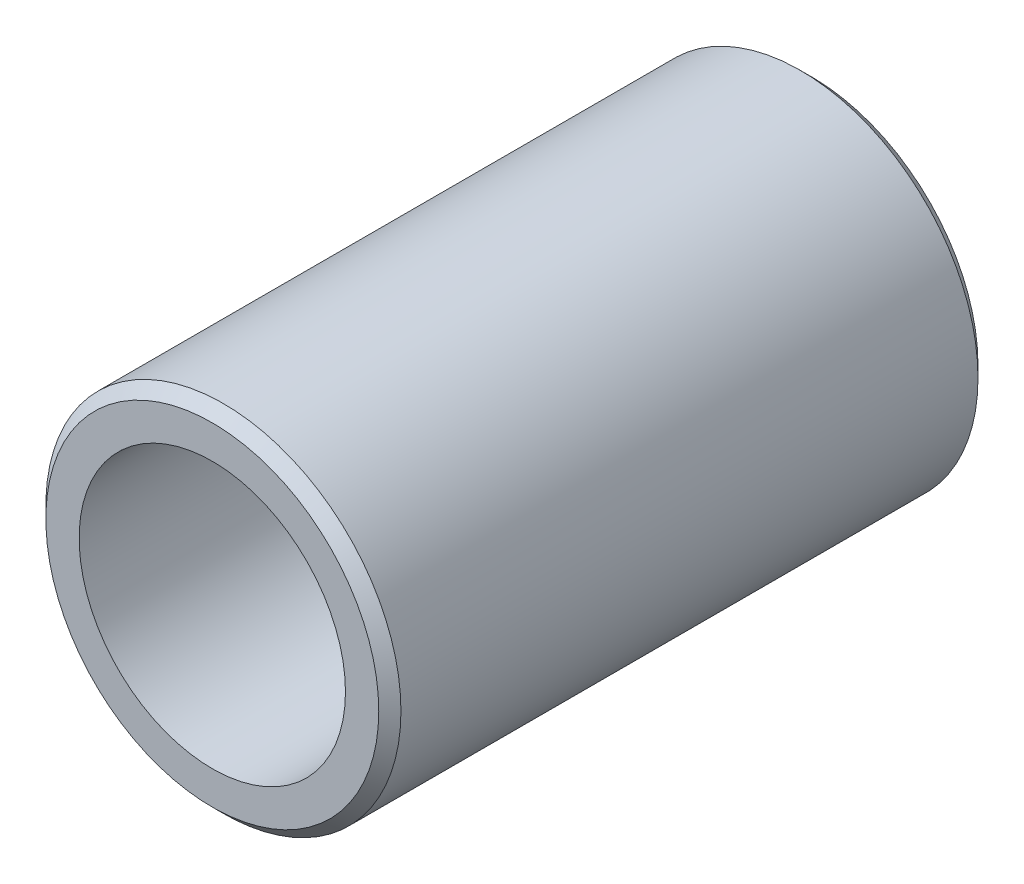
ISO-10303-21;
HEADER;
FILE_DESCRIPTION(('STEP AP214'),'2;1');
FILE_NAME('part.step','',(''),(''),'','','');
FILE_SCHEMA(('AUTOMOTIVE_DESIGN { 1 0 10303 214 1 1 1 1 }'));
ENDSEC;
DATA;
#1=APPLICATION_CONTEXT('core data for automotive mechanical design processes');
#2=APPLICATION_PROTOCOL_DEFINITION('international standard','automotive_design',2000,#1);
#3=PRODUCT_CONTEXT('',#1,'mechanical');
#4=PRODUCT('Part','Part','',(#3));
#5=PRODUCT_RELATED_PRODUCT_CATEGORY('part','',(#4));
#6=PRODUCT_DEFINITION_FORMATION('','',#4);
#7=PRODUCT_DEFINITION_CONTEXT('part definition',#1,'design');
#8=PRODUCT_DEFINITION('design','',#6,#7);
#9=PRODUCT_DEFINITION_SHAPE('','',#8);
#10=(LENGTH_UNIT() NAMED_UNIT(*) SI_UNIT(.MILLI.,.METRE.));
#11=(NAMED_UNIT(*) PLANE_ANGLE_UNIT() SI_UNIT($,.RADIAN.));
#12=(NAMED_UNIT(*) SI_UNIT($,.STERADIAN.) SOLID_ANGLE_UNIT());
#13=UNCERTAINTY_MEASURE_WITH_UNIT(LENGTH_MEASURE(1.E-05),#10,'distance_accuracy_value','');
#14=(GEOMETRIC_REPRESENTATION_CONTEXT(3) GLOBAL_UNCERTAINTY_ASSIGNED_CONTEXT((#13)) GLOBAL_UNIT_ASSIGNED_CONTEXT((#10,
#11,#12)) REPRESENTATION_CONTEXT('',''));
#15=CARTESIAN_POINT('',(0.,0.,0.));
#16=DIRECTION('',(0.,0.,1.));
#17=DIRECTION('',(1.,0.,0.));
#18=AXIS2_PLACEMENT_3D('',#15,#16,#17);
#19=CARTESIAN_POINT('',(0.,0.,27.));
#20=DIRECTION('',(0.,0.,1.));
#21=DIRECTION('',(1.,0.,0.));
#22=AXIS2_PLACEMENT_3D('',#19,#20,#21);
#23=PLANE('',#22);
#24=CARTESIAN_POINT('',(0.,0.,27.));
#25=DIRECTION('',(0.,0.,1.));
#26=DIRECTION('',(1.,0.,0.));
#27=AXIS2_PLACEMENT_3D('',#24,#25,#26);
#28=CIRCLE('',#27,7.49999999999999);
#29=CARTESIAN_POINT('',(7.49999999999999,0.,27.));
#30=VERTEX_POINT('',#29);
#31=EDGE_CURVE('E10',#30,#30,#28,.T.);
#32=ORIENTED_EDGE('',*,*,#31,.T.);
#33=EDGE_LOOP('',(#32));
#34=FACE_BOUND('',#33,.T.);
#35=CARTESIAN_POINT('',(0.,0.,27.));
#36=DIRECTION('',(0.,0.,1.));
#37=DIRECTION('',(1.,0.,0.));
#38=AXIS2_PLACEMENT_3D('',#35,#36,#37);
#39=CIRCLE('',#38,6.);
#40=CARTESIAN_POINT('',(6.,0.,27.));
#41=VERTEX_POINT('',#40);
#42=EDGE_CURVE('E50',#41,#41,#39,.T.);
#43=ORIENTED_EDGE('',*,*,#42,.F.);
#44=EDGE_LOOP('',(#43));
#45=FACE_BOUND('',#44,.T.);
#46=ADVANCED_FACE('F30',(#34,#45),#23,.T.);
#47=CARTESIAN_POINT('',(0.,0.,0.));
#48=DIRECTION('',(0.,0.,1.));
#49=DIRECTION('',(1.,0.,0.));
#50=AXIS2_PLACEMENT_3D('',#47,#48,#49);
#51=PLANE('',#50);
#52=CARTESIAN_POINT('',(0.,0.,0.));
#53=DIRECTION('',(0.,0.,1.));
#54=DIRECTION('',(1.,0.,0.));
#55=AXIS2_PLACEMENT_3D('',#52,#53,#54);
#56=CIRCLE('',#55,7.5);
#57=CARTESIAN_POINT('',(7.5,0.,0.));
#58=VERTEX_POINT('',#57);
#59=EDGE_CURVE('E37',#58,#58,#56,.F.);
#60=ORIENTED_EDGE('',*,*,#59,.T.);
#61=EDGE_LOOP('',(#60));
#62=FACE_BOUND('',#61,.T.);
#63=CARTESIAN_POINT('',(0.,0.,0.));
#64=DIRECTION('',(0.,0.,1.));
#65=DIRECTION('',(1.,0.,0.));
#66=AXIS2_PLACEMENT_3D('',#63,#64,#65);
#67=CIRCLE('',#66,6.);
#68=CARTESIAN_POINT('',(6.,0.,0.));
#69=VERTEX_POINT('',#68);
#70=EDGE_CURVE('E51',#69,#69,#67,.T.);
#71=ORIENTED_EDGE('',*,*,#70,.T.);
#72=EDGE_LOOP('',(#71));
#73=FACE_BOUND('',#72,.T.);
#74=ADVANCED_FACE('F61',(#62,#73),#51,.F.);
#75=CARTESIAN_POINT('',(0.,0.,27.));
#76=DIRECTION('',(0.,0.,-1.));
#77=DIRECTION('',(-1.,0.,0.));
#78=AXIS2_PLACEMENT_3D('',#75,#76,#77);
#79=CYLINDRICAL_SURFACE('',#78,8.);
#80=CARTESIAN_POINT('',(0.,0.,0.500000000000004));
#81=DIRECTION('',(0.,0.,1.));
#82=DIRECTION('',(1.,0.,0.));
#83=AXIS2_PLACEMENT_3D('',#80,#81,#82);
#84=CIRCLE('',#83,8.);
#85=CARTESIAN_POINT('',(8.,0.,0.500000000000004));
#86=VERTEX_POINT('',#85);
#87=EDGE_CURVE('E41',#86,#86,#84,.T.);
#88=ORIENTED_EDGE('',*,*,#87,.T.);
#89=EDGE_LOOP('',(#88));
#90=FACE_BOUND('',#89,.T.);
#91=CARTESIAN_POINT('',(0.,0.,26.5));
#92=DIRECTION('',(0.,0.,1.));
#93=DIRECTION('',(1.,0.,0.));
#94=AXIS2_PLACEMENT_3D('',#91,#92,#93);
#95=CIRCLE('',#94,8.);
#96=CARTESIAN_POINT('',(8.,0.,26.5));
#97=VERTEX_POINT('',#96);
#98=EDGE_CURVE('E45',#97,#97,#95,.F.);
#99=ORIENTED_EDGE('',*,*,#98,.T.);
#100=EDGE_LOOP('',(#99));
#101=FACE_BOUND('',#100,.T.);
#102=ADVANCED_FACE('F66',(#90,#101),#79,.T.);
#103=CARTESIAN_POINT('',(0.,0.,27.));
#104=DIRECTION('',(0.,0.,-1.));
#105=DIRECTION('',(-1.,0.,0.));
#106=AXIS2_PLACEMENT_3D('',#103,#104,#105);
#107=CYLINDRICAL_SURFACE('',#106,6.);
#108=ORIENTED_EDGE('',*,*,#42,.T.);
#109=EDGE_LOOP('',(#108));
#110=FACE_BOUND('',#109,.T.);
#111=ORIENTED_EDGE('',*,*,#70,.F.);
#112=EDGE_LOOP('',(#111));
#113=FACE_BOUND('',#112,.T.);
#114=ADVANCED_FACE('F57',(#110,#113),#107,.F.);
#115=CARTESIAN_POINT('',(0.,0.,0.500000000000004));
#116=DIRECTION('',(0.,0.,1.));
#117=DIRECTION('',(1.,0.,0.));
#118=AXIS2_PLACEMENT_3D('',#115,#116,#117);
#119=CONICAL_SURFACE('',#118,8.,0.785398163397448);
#120=ORIENTED_EDGE('',*,*,#59,.F.);
#121=EDGE_LOOP('',(#120));
#122=FACE_BOUND('',#121,.T.);
#123=ORIENTED_EDGE('',*,*,#87,.F.);
#124=EDGE_LOOP('',(#123));
#125=FACE_BOUND('',#124,.T.);
#126=ADVANCED_FACE('F72',(#122,#125),#119,.T.);
#127=CARTESIAN_POINT('',(0.,0.,27.));
#128=DIRECTION('',(0.,0.,-1.));
#129=DIRECTION('',(-1.,0.,0.));
#130=AXIS2_PLACEMENT_3D('',#127,#128,#129);
#131=CONICAL_SURFACE('',#130,7.49999999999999,0.785398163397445);
#132=ORIENTED_EDGE('',*,*,#98,.F.);
#133=EDGE_LOOP('',(#132));
#134=FACE_BOUND('',#133,.T.);
#135=ORIENTED_EDGE('',*,*,#31,.F.);
#136=EDGE_LOOP('',(#135));
#137=FACE_BOUND('',#136,.T.);
#138=ADVANCED_FACE('F32',(#134,#137),#131,.T.);
#139=CLOSED_SHELL('',(#46,#74,#102,#114,#126,#138));
#140=MANIFOLD_SOLID_BREP('B2',#139);
#141=ADVANCED_BREP_SHAPE_REPRESENTATION('',(#18,#140),#14);
#142=SHAPE_DEFINITION_REPRESENTATION(#9,#141);
ENDSEC;
END-ISO-10303-21;
